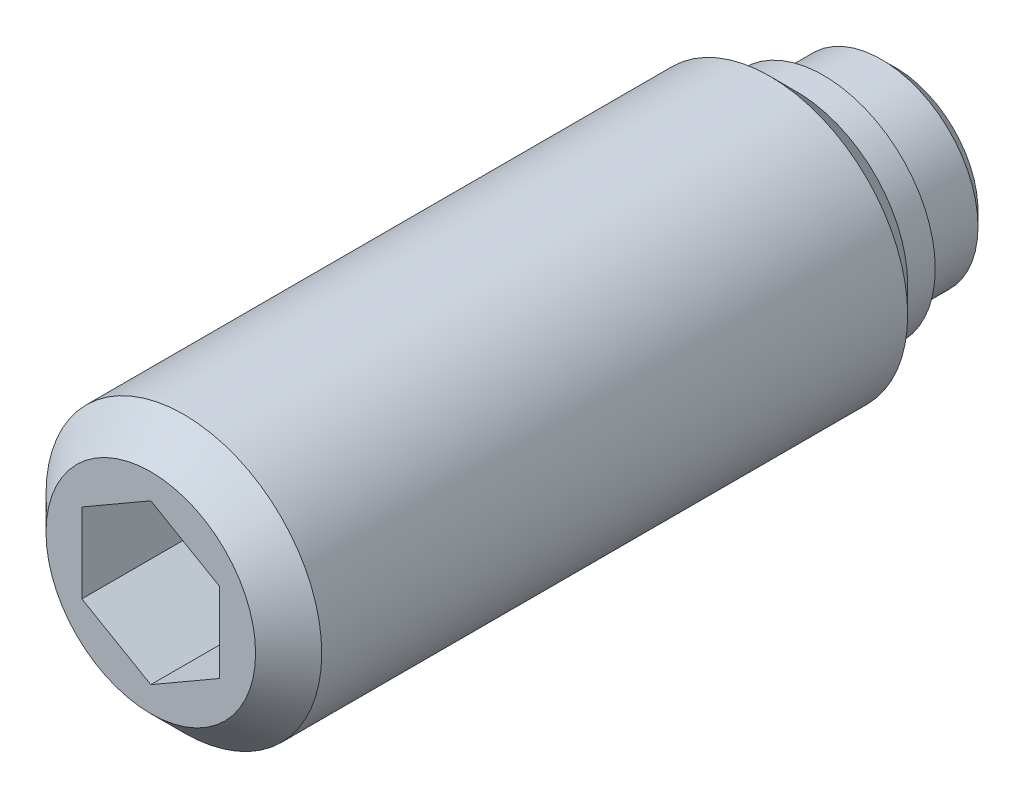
ISO-10303-21;
HEADER;
FILE_DESCRIPTION(('STEP AP214'),'2;1');
FILE_NAME('part.step','',(''),(''),'','','');
FILE_SCHEMA(('AUTOMOTIVE_DESIGN { 1 0 10303 214 1 1 1 1 }'));
ENDSEC;
DATA;
#1=APPLICATION_CONTEXT('core data for automotive mechanical design processes');
#2=APPLICATION_PROTOCOL_DEFINITION('international standard','automotive_design',2000,#1);
#3=PRODUCT_CONTEXT('',#1,'mechanical');
#4=PRODUCT('Part','Part','',(#3));
#5=PRODUCT_RELATED_PRODUCT_CATEGORY('part','',(#4));
#6=PRODUCT_DEFINITION_FORMATION('','',#4);
#7=PRODUCT_DEFINITION_CONTEXT('part definition',#1,'design');
#8=PRODUCT_DEFINITION('design','',#6,#7);
#9=PRODUCT_DEFINITION_SHAPE('','',#8);
#10=(LENGTH_UNIT() NAMED_UNIT(*) SI_UNIT(.MILLI.,.METRE.));
#11=(NAMED_UNIT(*) PLANE_ANGLE_UNIT() SI_UNIT($,.RADIAN.));
#12=(NAMED_UNIT(*) SI_UNIT($,.STERADIAN.) SOLID_ANGLE_UNIT());
#13=UNCERTAINTY_MEASURE_WITH_UNIT(LENGTH_MEASURE(1.E-05),#10,'distance_accuracy_value','');
#14=(GEOMETRIC_REPRESENTATION_CONTEXT(3) GLOBAL_UNCERTAINTY_ASSIGNED_CONTEXT((#13)) GLOBAL_UNIT_ASSIGNED_CONTEXT((#10,
#11,#12)) REPRESENTATION_CONTEXT('',''));
#15=CARTESIAN_POINT('',(0.,0.,0.));
#16=DIRECTION('',(0.,0.,1.));
#17=DIRECTION('',(1.,0.,0.));
#18=AXIS2_PLACEMENT_3D('',#15,#16,#17);
#19=CARTESIAN_POINT('',(0.,0.,2.6));
#20=DIRECTION('',(0.,0.,-1.));
#21=DIRECTION('',(-1.,0.,0.));
#22=AXIS2_PLACEMENT_3D('',#19,#20,#21);
#23=CYLINDRICAL_SURFACE('',#22,5.);
#24=CARTESIAN_POINT('',(0.,0.,4.55));
#25=DIRECTION('',(0.,0.,-1.));
#26=DIRECTION('',(-1.,0.,0.));
#27=AXIS2_PLACEMENT_3D('',#24,#25,#26);
#28=CIRCLE('',#27,5.);
#29=CARTESIAN_POINT('',(-5.,0.,4.55));
#30=VERTEX_POINT('',#29);
#31=EDGE_CURVE('E9',#30,#30,#28,.T.);
#32=ORIENTED_EDGE('',*,*,#31,.F.);
#33=EDGE_LOOP('',(#32));
#34=FACE_BOUND('',#33,.T.);
#35=CARTESIAN_POINT('',(0.,0.,25.8));
#36=DIRECTION('',(0.,0.,1.));
#37=DIRECTION('',(1.,0.,0.));
#38=AXIS2_PLACEMENT_3D('',#35,#36,#37);
#39=CIRCLE('',#38,5.);
#40=CARTESIAN_POINT('',(5.,0.,25.8));
#41=VERTEX_POINT('',#40);
#42=EDGE_CURVE('E123',#41,#41,#39,.T.);
#43=ORIENTED_EDGE('',*,*,#42,.F.);
#44=EDGE_LOOP('',(#43));
#45=FACE_BOUND('',#44,.T.);
#46=ADVANCED_FACE('F14',(#34,#45),#23,.T.);
#47=CARTESIAN_POINT('',(0.,0.,4.55));
#48=DIRECTION('',(0.,0.,1.));
#49=DIRECTION('',(1.,0.,0.));
#50=AXIS2_PLACEMENT_3D('',#47,#48,#49);
#51=CONICAL_SURFACE('',#50,5.,0.785398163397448);
#52=ORIENTED_EDGE('',*,*,#31,.T.);
#53=EDGE_LOOP('',(#52));
#54=FACE_BOUND('',#53,.T.);
#55=CARTESIAN_POINT('',(0.,0.,3.6));
#56=DIRECTION('',(0.,0.,-1.));
#57=DIRECTION('',(-1.,0.,0.));
#58=AXIS2_PLACEMENT_3D('',#55,#56,#57);
#59=CIRCLE('',#58,4.05);
#60=CARTESIAN_POINT('',(-4.05,0.,3.6));
#61=VERTEX_POINT('',#60);
#62=EDGE_CURVE('E21',#61,#61,#59,.T.);
#63=ORIENTED_EDGE('',*,*,#62,.F.);
#64=EDGE_LOOP('',(#63));
#65=FACE_BOUND('',#64,.T.);
#66=ADVANCED_FACE('F143',(#54,#65),#51,.T.);
#67=CARTESIAN_POINT('',(0.,0.,2.6));
#68=DIRECTION('',(0.,0.,-1.));
#69=DIRECTION('',(-1.,0.,0.));
#70=AXIS2_PLACEMENT_3D('',#67,#68,#69);
#71=CYLINDRICAL_SURFACE('',#70,4.05);
#72=ORIENTED_EDGE('',*,*,#62,.T.);
#73=EDGE_LOOP('',(#72));
#74=FACE_BOUND('',#73,.T.);
#75=CARTESIAN_POINT('',(0.,0.,2.6));
#76=DIRECTION('',(0.,0.,-1.));
#77=DIRECTION('',(-1.,0.,0.));
#78=AXIS2_PLACEMENT_3D('',#75,#76,#77);
#79=CIRCLE('',#78,4.05);
#80=CARTESIAN_POINT('',(-4.05,0.,2.6));
#81=VERTEX_POINT('',#80);
#82=EDGE_CURVE('E135',#81,#81,#79,.T.);
#83=ORIENTED_EDGE('',*,*,#82,.F.);
#84=EDGE_LOOP('',(#83));
#85=FACE_BOUND('',#84,.T.);
#86=ADVANCED_FACE('F140',(#74,#85),#71,.T.);
#87=CARTESIAN_POINT('',(0.,4.05,2.6));
#88=DIRECTION('',(0.,0.,1.));
#89=DIRECTION('',(1.,0.,0.));
#90=AXIS2_PLACEMENT_3D('',#87,#88,#89);
#91=PLANE('',#90);
#92=ORIENTED_EDGE('',*,*,#82,.T.);
#93=EDGE_LOOP('',(#92));
#94=FACE_BOUND('',#93,.T.);
#95=CARTESIAN_POINT('',(0.,0.,2.6));
#96=DIRECTION('',(0.,0.,-1.));
#97=DIRECTION('',(-1.,0.,0.));
#98=AXIS2_PLACEMENT_3D('',#95,#96,#97);
#99=CIRCLE('',#98,3.5);
#100=CARTESIAN_POINT('',(-3.5,0.,2.6));
#101=VERTEX_POINT('',#100);
#102=EDGE_CURVE('E132',#101,#101,#99,.T.);
#103=ORIENTED_EDGE('',*,*,#102,.F.);
#104=EDGE_LOOP('',(#103));
#105=FACE_BOUND('',#104,.T.);
#106=ADVANCED_FACE('F151',(#94,#105),#91,.F.);
#107=CARTESIAN_POINT('',(0.,0.,0.));
#108=DIRECTION('',(0.,0.,-1.));
#109=DIRECTION('',(-1.,0.,0.));
#110=AXIS2_PLACEMENT_3D('',#107,#108,#109);
#111=CYLINDRICAL_SURFACE('',#110,3.5);
#112=CARTESIAN_POINT('',(0.,0.,0.5));
#113=DIRECTION('',(0.,0.,-1.));
#114=DIRECTION('',(-1.,0.,0.));
#115=AXIS2_PLACEMENT_3D('',#112,#113,#114);
#116=CIRCLE('',#115,3.5);
#117=CARTESIAN_POINT('',(-3.5,0.,0.5));
#118=VERTEX_POINT('',#117);
#119=EDGE_CURVE('E129',#118,#118,#116,.T.);
#120=ORIENTED_EDGE('',*,*,#119,.F.);
#121=EDGE_LOOP('',(#120));
#122=FACE_BOUND('',#121,.T.);
#123=ORIENTED_EDGE('',*,*,#102,.T.);
#124=EDGE_LOOP('',(#123));
#125=FACE_BOUND('',#124,.T.);
#126=ADVANCED_FACE('F157',(#122,#125),#111,.T.);
#127=CARTESIAN_POINT('',(0.,0.,0.5));
#128=DIRECTION('',(0.,0.,1.));
#129=DIRECTION('',(1.,0.,0.));
#130=AXIS2_PLACEMENT_3D('',#127,#128,#129);
#131=CONICAL_SURFACE('',#130,3.5,0.785398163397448);
#132=CARTESIAN_POINT('',(0.,0.,0.));
#133=DIRECTION('',(0.,0.,-1.));
#134=DIRECTION('',(-1.,0.,0.));
#135=AXIS2_PLACEMENT_3D('',#132,#133,#134);
#136=CIRCLE('',#135,3.);
#137=CARTESIAN_POINT('',(-3.,0.,0.));
#138=VERTEX_POINT('',#137);
#139=EDGE_CURVE('E126',#138,#138,#136,.T.);
#140=ORIENTED_EDGE('',*,*,#139,.F.);
#141=EDGE_LOOP('',(#140));
#142=FACE_BOUND('',#141,.T.);
#143=ORIENTED_EDGE('',*,*,#119,.T.);
#144=EDGE_LOOP('',(#143));
#145=FACE_BOUND('',#144,.T.);
#146=ADVANCED_FACE('F161',(#142,#145),#131,.T.);
#147=CARTESIAN_POINT('',(0.,3.,0.));
#148=DIRECTION('',(0.,0.,1.));
#149=DIRECTION('',(1.,0.,0.));
#150=AXIS2_PLACEMENT_3D('',#147,#148,#149);
#151=PLANE('',#150);
#152=ORIENTED_EDGE('',*,*,#139,.T.);
#153=EDGE_LOOP('',(#152));
#154=FACE_BOUND('',#153,.T.);
#155=ADVANCED_FACE('F165',(#154),#151,.F.);
#156=CARTESIAN_POINT('',(0.,0.,27.));
#157=DIRECTION('',(0.,0.,-1.));
#158=DIRECTION('',(-1.,0.,0.));
#159=AXIS2_PLACEMENT_3D('',#156,#157,#158);
#160=CONICAL_SURFACE('',#159,3.8,0.785398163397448);
#161=ORIENTED_EDGE('',*,*,#42,.T.);
#162=EDGE_LOOP('',(#161));
#163=FACE_BOUND('',#162,.T.);
#164=CARTESIAN_POINT('',(0.,0.,27.));
#165=DIRECTION('',(0.,0.,1.));
#166=DIRECTION('',(1.,0.,0.));
#167=AXIS2_PLACEMENT_3D('',#164,#165,#166);
#168=CIRCLE('',#167,3.8);
#169=CARTESIAN_POINT('',(3.8,0.,27.));
#170=VERTEX_POINT('',#169);
#171=EDGE_CURVE('E115',#170,#170,#168,.T.);
#172=ORIENTED_EDGE('',*,*,#171,.F.);
#173=EDGE_LOOP('',(#172));
#174=FACE_BOUND('',#173,.T.);
#175=ADVANCED_FACE('F169',(#163,#174),#160,.T.);
#176=CARTESIAN_POINT('',(0.,-3.8,27.));
#177=DIRECTION('',(0.,0.,1.));
#178=DIRECTION('',(1.,0.,0.));
#179=AXIS2_PLACEMENT_3D('',#176,#177,#178);
#180=PLANE('',#179);
#181=DIRECTION('',(0.866025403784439,-0.5,0.));
#182=VECTOR('',#181,1.);
#183=CARTESIAN_POINT('',(-2.5,-1.44337567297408,27.));
#184=LINE('',#183,#182);
#185=CARTESIAN_POINT('',(-2.5,-1.44337567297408,27.));
#186=VERTEX_POINT('',#185);
#187=CARTESIAN_POINT('',(0.,-2.88675134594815,27.));
#188=VERTEX_POINT('',#187);
#189=EDGE_CURVE('E28',#186,#188,#184,.T.);
#190=ORIENTED_EDGE('',*,*,#189,.F.);
#191=DIRECTION('',(0.,-1.,0.));
#192=VECTOR('',#191,1.);
#193=CARTESIAN_POINT('',(-2.5,1.44337567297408,27.));
#194=LINE('',#193,#192);
#195=CARTESIAN_POINT('',(-2.5,1.44337567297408,27.));
#196=VERTEX_POINT('',#195);
#197=EDGE_CURVE('E111',#196,#186,#194,.T.);
#198=ORIENTED_EDGE('',*,*,#197,.F.);
#199=DIRECTION('',(-0.866025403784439,-0.5,0.));
#200=VECTOR('',#199,1.);
#201=CARTESIAN_POINT('',(0.,2.88675134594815,27.));
#202=LINE('',#201,#200);
#203=CARTESIAN_POINT('',(0.,2.88675134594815,27.));
#204=VERTEX_POINT('',#203);
#205=EDGE_CURVE('E109',#204,#196,#202,.T.);
#206=ORIENTED_EDGE('',*,*,#205,.F.);
#207=DIRECTION('',(-0.866025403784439,0.5,0.));
#208=VECTOR('',#207,1.);
#209=CARTESIAN_POINT('',(2.5,1.44337567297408,27.));
#210=LINE('',#209,#208);
#211=CARTESIAN_POINT('',(2.5,1.44337567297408,27.));
#212=VERTEX_POINT('',#211);
#213=EDGE_CURVE('E76',#212,#204,#210,.T.);
#214=ORIENTED_EDGE('',*,*,#213,.F.);
#215=DIRECTION('',(0.,1.,0.));
#216=VECTOR('',#215,1.);
#217=CARTESIAN_POINT('',(2.5,-1.44337567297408,27.));
#218=LINE('',#217,#216);
#219=CARTESIAN_POINT('',(2.5,-1.44337567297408,27.));
#220=VERTEX_POINT('',#219);
#221=EDGE_CURVE('E105',#220,#212,#218,.T.);
#222=ORIENTED_EDGE('',*,*,#221,.F.);
#223=DIRECTION('',(0.866025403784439,0.5,0.));
#224=VECTOR('',#223,1.);
#225=CARTESIAN_POINT('',(0.,-2.88675134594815,27.));
#226=LINE('',#225,#224);
#227=EDGE_CURVE('E102',#188,#220,#226,.T.);
#228=ORIENTED_EDGE('',*,*,#227,.F.);
#229=EDGE_LOOP('',(#190,#198,#206,#214,#222,#228));
#230=FACE_BOUND('',#229,.T.);
#231=ORIENTED_EDGE('',*,*,#171,.T.);
#232=EDGE_LOOP('',(#231));
#233=FACE_BOUND('',#232,.T.);
#234=ADVANCED_FACE('F173',(#230,#233),#180,.T.);
#235=CARTESIAN_POINT('',(-2.5,-1.44337567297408,21.));
#236=DIRECTION('',(-0.5,-0.866025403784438,0.));
#237=DIRECTION('',(0.866025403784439,-0.5,0.));
#238=AXIS2_PLACEMENT_3D('',#235,#236,#237);
#239=PLANE('',#238);
#240=ORIENTED_EDGE('',*,*,#189,.T.);
#241=DIRECTION('',(0.,0.,1.));
#242=VECTOR('',#241,1.);
#243=CARTESIAN_POINT('',(0.,-2.88675134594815,21.));
#244=LINE('',#243,#242);
#245=CARTESIAN_POINT('',(0.,-2.88675134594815,21.));
#246=VERTEX_POINT('',#245);
#247=EDGE_CURVE('E58',#246,#188,#244,.T.);
#248=ORIENTED_EDGE('',*,*,#247,.F.);
#249=DIRECTION('',(0.866025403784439,-0.5,0.));
#250=VECTOR('',#249,1.);
#251=CARTESIAN_POINT('',(-2.5,-1.44337567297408,21.));
#252=LINE('',#251,#250);
#253=CARTESIAN_POINT('',(-2.5,-1.44337567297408,21.));
#254=VERTEX_POINT('',#253);
#255=EDGE_CURVE('E113',#254,#246,#252,.T.);
#256=ORIENTED_EDGE('',*,*,#255,.F.);
#257=DIRECTION('',(0.,0.,1.));
#258=VECTOR('',#257,1.);
#259=CARTESIAN_POINT('',(-2.5,-1.44337567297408,21.));
#260=LINE('',#259,#258);
#261=EDGE_CURVE('E36',#254,#186,#260,.T.);
#262=ORIENTED_EDGE('',*,*,#261,.T.);
#263=EDGE_LOOP('',(#240,#248,#256,#262));
#264=FACE_BOUND('',#263,.T.);
#265=ADVANCED_FACE('F177',(#264),#239,.F.);
#266=CARTESIAN_POINT('',(-2.5,1.44337567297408,21.));
#267=DIRECTION('',(-1.,0.,0.));
#268=DIRECTION('',(0.,0.,1.));
#269=AXIS2_PLACEMENT_3D('',#266,#267,#268);
#270=PLANE('',#269);
#271=ORIENTED_EDGE('',*,*,#197,.T.);
#272=ORIENTED_EDGE('',*,*,#261,.F.);
#273=DIRECTION('',(0.,-1.,0.));
#274=VECTOR('',#273,1.);
#275=CARTESIAN_POINT('',(-2.5,1.44337567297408,21.));
#276=LINE('',#275,#274);
#277=CARTESIAN_POINT('',(-2.5,1.44337567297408,21.));
#278=VERTEX_POINT('',#277);
#279=EDGE_CURVE('E88',#278,#254,#276,.T.);
#280=ORIENTED_EDGE('',*,*,#279,.F.);
#281=DIRECTION('',(0.,0.,1.));
#282=VECTOR('',#281,1.);
#283=CARTESIAN_POINT('',(-2.5,1.44337567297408,21.));
#284=LINE('',#283,#282);
#285=EDGE_CURVE('E80',#278,#196,#284,.T.);
#286=ORIENTED_EDGE('',*,*,#285,.T.);
#287=EDGE_LOOP('',(#271,#272,#280,#286));
#288=FACE_BOUND('',#287,.T.);
#289=ADVANCED_FACE('F181',(#288),#270,.F.);
#290=CARTESIAN_POINT('',(0.,2.88675134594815,21.));
#291=DIRECTION('',(-0.5,0.866025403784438,0.));
#292=DIRECTION('',(-0.866025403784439,-0.5,0.));
#293=AXIS2_PLACEMENT_3D('',#290,#291,#292);
#294=PLANE('',#293);
#295=ORIENTED_EDGE('',*,*,#205,.T.);
#296=ORIENTED_EDGE('',*,*,#285,.F.);
#297=DIRECTION('',(-0.866025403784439,-0.5,0.));
#298=VECTOR('',#297,1.);
#299=CARTESIAN_POINT('',(0.,2.88675134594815,21.));
#300=LINE('',#299,#298);
#301=CARTESIAN_POINT('',(0.,2.88675134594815,21.));
#302=VERTEX_POINT('',#301);
#303=EDGE_CURVE('E84',#302,#278,#300,.T.);
#304=ORIENTED_EDGE('',*,*,#303,.F.);
#305=DIRECTION('',(0.,0.,1.));
#306=VECTOR('',#305,1.);
#307=CARTESIAN_POINT('',(0.,2.88675134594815,21.));
#308=LINE('',#307,#306);
#309=EDGE_CURVE('E69',#302,#204,#308,.T.);
#310=ORIENTED_EDGE('',*,*,#309,.T.);
#311=EDGE_LOOP('',(#295,#296,#304,#310));
#312=FACE_BOUND('',#311,.T.);
#313=ADVANCED_FACE('F85',(#312),#294,.F.);
#314=CARTESIAN_POINT('',(2.5,1.44337567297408,21.));
#315=DIRECTION('',(0.5,0.866025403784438,0.));
#316=DIRECTION('',(-0.866025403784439,0.5,0.));
#317=AXIS2_PLACEMENT_3D('',#314,#315,#316);
#318=PLANE('',#317);
#319=ORIENTED_EDGE('',*,*,#213,.T.);
#320=ORIENTED_EDGE('',*,*,#309,.F.);
#321=DIRECTION('',(-0.866025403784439,0.5,0.));
#322=VECTOR('',#321,1.);
#323=CARTESIAN_POINT('',(2.5,1.44337567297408,21.));
#324=LINE('',#323,#322);
#325=CARTESIAN_POINT('',(2.5,1.44337567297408,21.));
#326=VERTEX_POINT('',#325);
#327=EDGE_CURVE('E73',#326,#302,#324,.T.);
#328=ORIENTED_EDGE('',*,*,#327,.F.);
#329=DIRECTION('',(0.,0.,1.));
#330=VECTOR('',#329,1.);
#331=CARTESIAN_POINT('',(2.5,1.44337567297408,21.));
#332=LINE('',#331,#330);
#333=EDGE_CURVE('E81',#326,#212,#332,.T.);
#334=ORIENTED_EDGE('',*,*,#333,.T.);
#335=EDGE_LOOP('',(#319,#320,#328,#334));
#336=FACE_BOUND('',#335,.T.);
#337=ADVANCED_FACE('F71',(#336),#318,.F.);
#338=CARTESIAN_POINT('',(2.5,-1.44337567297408,21.));
#339=DIRECTION('',(1.,0.,0.));
#340=DIRECTION('',(0.,0.,-1.));
#341=AXIS2_PLACEMENT_3D('',#338,#339,#340);
#342=PLANE('',#341);
#343=ORIENTED_EDGE('',*,*,#221,.T.);
#344=ORIENTED_EDGE('',*,*,#333,.F.);
#345=DIRECTION('',(0.,1.,0.));
#346=VECTOR('',#345,1.);
#347=CARTESIAN_POINT('',(2.5,-1.44337567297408,21.));
#348=LINE('',#347,#346);
#349=CARTESIAN_POINT('',(2.5,-1.44337567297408,21.));
#350=VERTEX_POINT('',#349);
#351=EDGE_CURVE('E94',#350,#326,#348,.T.);
#352=ORIENTED_EDGE('',*,*,#351,.F.);
#353=DIRECTION('',(0.,0.,1.));
#354=VECTOR('',#353,1.);
#355=CARTESIAN_POINT('',(2.5,-1.44337567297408,21.));
#356=LINE('',#355,#354);
#357=EDGE_CURVE('E118',#350,#220,#356,.T.);
#358=ORIENTED_EDGE('',*,*,#357,.T.);
#359=EDGE_LOOP('',(#343,#344,#352,#358));
#360=FACE_BOUND('',#359,.T.);
#361=ADVANCED_FACE('F185',(#360),#342,.F.);
#362=CARTESIAN_POINT('',(0.,-2.88675134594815,21.));
#363=DIRECTION('',(0.5,-0.866025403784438,0.));
#364=DIRECTION('',(0.866025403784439,0.5,0.));
#365=AXIS2_PLACEMENT_3D('',#362,#363,#364);
#366=PLANE('',#365);
#367=ORIENTED_EDGE('',*,*,#227,.T.);
#368=ORIENTED_EDGE('',*,*,#357,.F.);
#369=DIRECTION('',(0.866025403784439,0.5,0.));
#370=VECTOR('',#369,1.);
#371=CARTESIAN_POINT('',(0.,-2.88675134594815,21.));
#372=LINE('',#371,#370);
#373=EDGE_CURVE('E96',#246,#350,#372,.T.);
#374=ORIENTED_EDGE('',*,*,#373,.F.);
#375=ORIENTED_EDGE('',*,*,#247,.T.);
#376=EDGE_LOOP('',(#367,#368,#374,#375));
#377=FACE_BOUND('',#376,.T.);
#378=ADVANCED_FACE('F182',(#377),#366,.F.);
#379=CARTESIAN_POINT('',(0.,0.,21.));
#380=DIRECTION('',(0.,0.,1.));
#381=DIRECTION('',(1.,0.,0.));
#382=AXIS2_PLACEMENT_3D('',#379,#380,#381);
#383=PLANE('',#382);
#384=ORIENTED_EDGE('',*,*,#255,.T.);
#385=ORIENTED_EDGE('',*,*,#373,.T.);
#386=ORIENTED_EDGE('',*,*,#351,.T.);
#387=ORIENTED_EDGE('',*,*,#327,.T.);
#388=ORIENTED_EDGE('',*,*,#303,.T.);
#389=ORIENTED_EDGE('',*,*,#279,.T.);
#390=EDGE_LOOP('',(#384,#385,#386,#387,#388,#389));
#391=FACE_BOUND('',#390,.T.);
#392=ADVANCED_FACE('F91',(#391),#383,.T.);
#393=CLOSED_SHELL('',(#46,#66,#86,#106,#126,#146,#155,#175,#234,#265,#289,#313,#337,#361,#378,#392));
#394=MANIFOLD_SOLID_BREP('B1',#393);
#395=ADVANCED_BREP_SHAPE_REPRESENTATION('',(#18,#394),#14);
#396=SHAPE_DEFINITION_REPRESENTATION(#9,#395);
ENDSEC;
END-ISO-10303-21;
